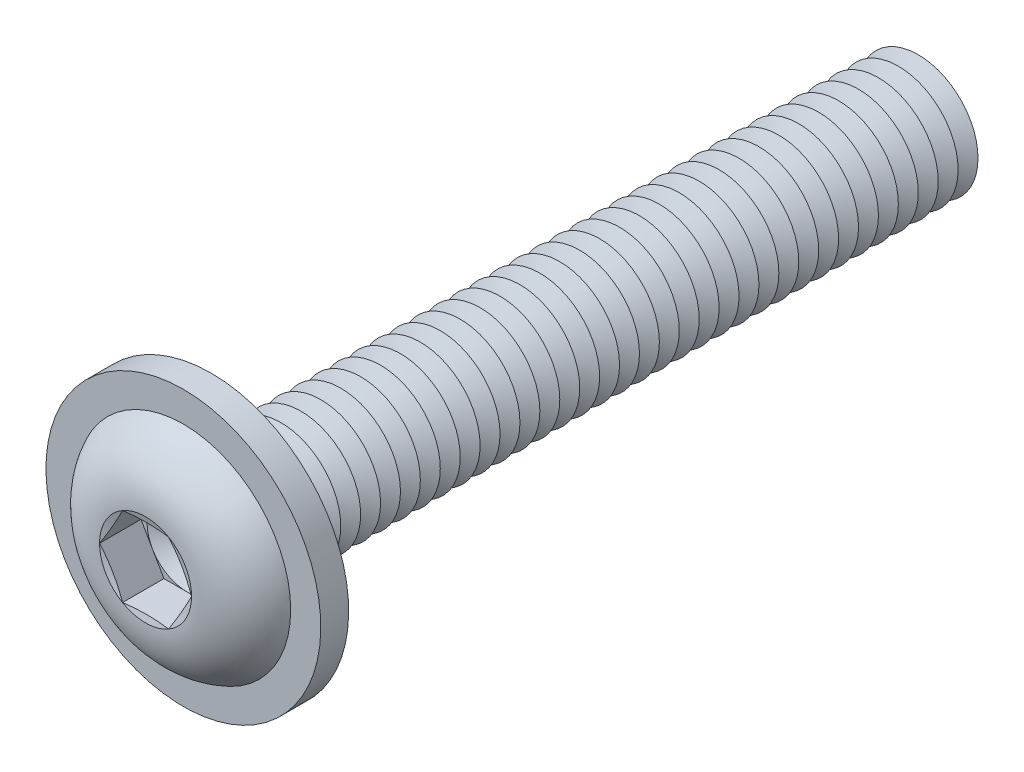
from build123d import *

# Parameters (mm, degrees)
FILLET1_R           = 0.25
LPATTERN1_COUNT     = 36
LPATTERN1_PITCH     = 0.5
CUT_EXTRUDE1_DEPTH  = 1.04
SKETCH5_R           = 3.45
SKETCH5_R_2         = 1.75
BOSS_EXTRUDE1_DEPTH = 0.7


with BuildPart() as part:
    # Sketch1 → Revolve1 (revolve)
    with BuildSketch(Plane(origin=(0, 0, 0), x_dir=(0, 0, -1), z_dir=(1, 0, 0)), mode=Mode.PRIVATE) as revolve1_sk:
        with BuildLine():
            Line((0, 1.5), (0, 2.85))
            ThreePointArc((0, 2.85), (-1.182850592, 2.35063849), (-1.65, 1.1547))
            Line((-1.65, 1.1547), (-1.495299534, 0.57735))
            Line((-1.495299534, 0.57735), (-1.65, 0.57735))
            Line((-1.65, 0.57735), (-1.65, 0))
            Line((-1.65, 0), (18, 0))
            Line((18, 0), (18, 1.5))
            Line((18, 1.5), (0, 1.5))
        make_face()
    revolve(revolve1_sk.sketch.rotate(Axis((0, 0, -18), (0, 0, 1)), 90), axis=Axis((0, 0, -18), (0, 0, 1)))

    # Fillet1
    fillet1_edges = [part.edges().sort_by_distance(p)[0] for p in [
        (1.5, 0, 0),
    ]]
    fillet(fillet1_edges, radius=FILLET1_R)

    # Sketch2 → Cut-Revolve1 (revolve, cut)
    with BuildSketch(Plane(origin=(0, 0, 0), x_dir=(0, 0, -1), z_dir=(1, 0, 0)), mode=Mode.PRIVATE) as cut_revolve1_sk:
        Polygon((17.75, 1.5), (18.25, 1.5), (18, 1.066987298), align=None)
    cut_revolve1 = revolve(cut_revolve1_sk.sketch.rotate(Axis((0, 0, -18), (0, 0, -1)), 270), axis=Axis((0, 0, -18), (0, 0, -1)), mode=Mode.SUBTRACT)

    # LPattern1: Cut-Revolve1 ×36
    with Locations(*[(0, 0, i * LPATTERN1_PITCH) for i in range(1, LPATTERN1_COUNT)]):
        add(cut_revolve1, mode=Mode.SUBTRACT)

    # Sketch3 → Cut-Extrude1 (cut)
    with BuildSketch(Plane.XY.offset(1.65)):
        Polygon((0.57735, 0.999999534), (-0.57735, 0.999999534), (-1.1547, 0), (-0.57735, -0.999999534), (0.57735, -0.999999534), (1.1547, 0), align=None)
    extrude(amount=-CUT_EXTRUDE1_DEPTH, mode=Mode.SUBTRACT)

    # Cut-Extrude2 cone 1 section (on through the dimple's axis) → Cut-Extrude2 (revolve, cut)
    with BuildSketch(Plane(origin=(0, 0, 0.61), x_dir=(0, -1, 0), z_dir=(1, 0, 0))):
        Polygon((0, 0), (0.999999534, 0), (0, 0.57735), align=None)
    revolve(axis=Axis((0, 0, 0.61), (0, 0, -1)), mode=Mode.SUBTRACT)

    # Sketch5 → Boss-Extrude1 (add)
    with BuildSketch(Plane(origin=(0, 0, 0), x_dir=(-1, 0, 0), z_dir=(0, 0, -1))):
        with Locations(Location((0, 0, 0), (0, 0, 90))):
            Circle(SKETCH5_R)
        Circle(SKETCH5_R_2, mode=Mode.SUBTRACT)
    extrude(amount=-BOSS_EXTRUDE1_DEPTH)


solid = part.part
